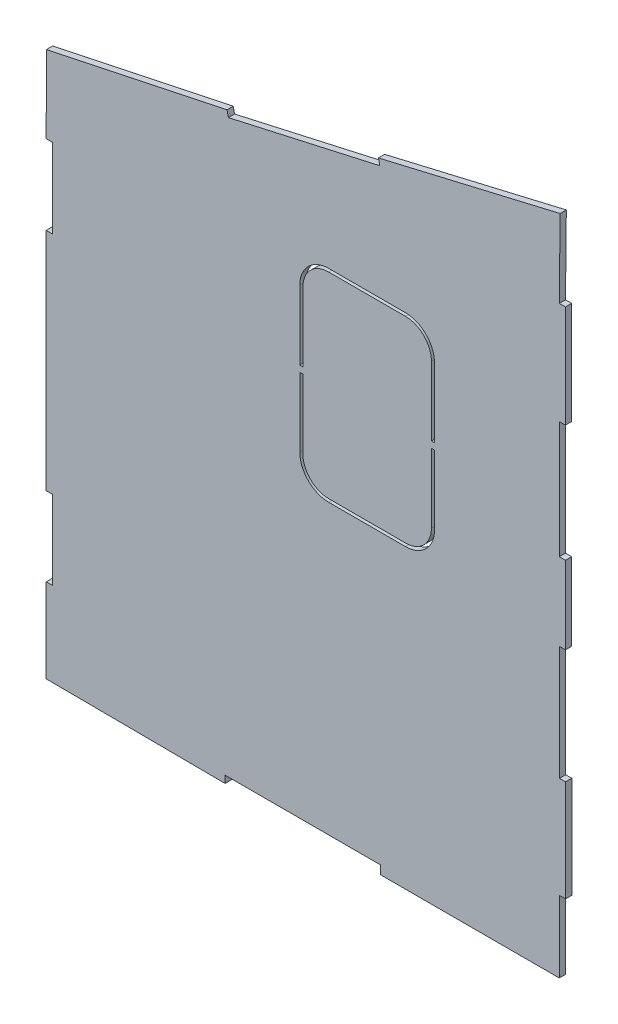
from build123d import *

# Parameters (mm, degrees)
BOSS_EXTRUDE1_DEPTH = 1.524
CUT_EXTRUDE1_DEPTH  = 1.524


with BuildPart() as part:
    # Sketch1 → Boss-Extrude1 (new body)
    with BuildSketch(Plane.XY):
        Polygon((9.092667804, 73.777555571), (9.043222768, 54.80583571), (10.60405165, 54.80583571), (10.557845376, 35.310728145), (9.043222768, 35.310728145), (9.043222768, -20.0520327), (10.601873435, -20.042029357), (10.601873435, -39.416526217), (9.043222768, -39.416526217), (9.043222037, -60.053816), (52.984742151, -60.324890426), (52.982423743, -58.565910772), (91.082423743, -58.565910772), (91.082423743, -60.671074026), (135.021624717, -60.671074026), (135.021624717, -43.08047166), (136.573671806, -43.08047166), (136.573671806, -18.16378675), (135.020697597, -18.229383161), (135.020697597, 9.858365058), (136.544697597, 9.858365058), (136.544697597, 28.908365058), (135.020697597, 28.908365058), (135.020697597, 57.632604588), (136.545359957, 57.654428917), (136.545359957, 82.788941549), (135.02455543, 82.763282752), (135.226572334, 101.990253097), (90.617790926, 91.505168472), (90.952162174, 90.018302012), (53.780500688, 81.659020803), (53.446129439, 83.145887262), align=None)
    extrude(amount=BOSS_EXTRUDE1_DEPTH)

    # Sketch2 → Cut-Extrude1 (cut)
    with BuildSketch(Plane.XY.offset(1.524)):
        with BuildLine():
            Line((104.388141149, 54.793396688), (104.388141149, 37.804892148))
            Line((104.388141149, 37.804892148), (103.626141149, 37.804892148))
            Line((103.626141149, 37.804892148), (103.626141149, 54.793396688))
            ThreePointArc((103.626141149, 54.793396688), (101.766269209, 59.283524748), (97.276141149, 61.143396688))
            Line((97.276141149, 61.143396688), (78.415983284, 61.143396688))
            ThreePointArc((78.415983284, 61.143396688), (73.925855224, 59.283524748), (72.065983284, 54.793396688))
            Line((72.065983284, 54.793396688), (72.065983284, 37.804892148))
            Line((72.065983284, 37.804892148), (71.303983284, 37.804892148))
            Line((71.303983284, 37.804892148), (71.303983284, 54.793396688))
            ThreePointArc((71.303983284, 54.793396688), (73.387039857, 59.822340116), (78.415983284, 61.905396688))
            Line((78.415983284, 61.905396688), (97.276141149, 61.905396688))
            ThreePointArc((97.276141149, 61.905396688), (102.305084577, 59.822340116), (104.388141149, 54.793396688))
        make_face()
        with BuildLine():
            Line((78.415983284, 12.942387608), (97.276141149, 12.942387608))
            ThreePointArc((97.276141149, 12.942387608), (101.766269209, 14.802259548), (103.626141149, 19.292387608))
            Line((103.626141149, 19.292387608), (103.626141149, 36.280892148))
            Line((103.626141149, 36.280892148), (104.388141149, 36.280892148))
            Line((104.388141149, 36.280892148), (104.388141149, 19.292387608))
            ThreePointArc((104.388141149, 19.292387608), (102.305084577, 14.263444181), (97.276141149, 12.180387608))
            Line((97.276141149, 12.180387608), (78.415983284, 12.180387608))
            ThreePointArc((78.415983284, 12.180387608), (73.387039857, 14.263444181), (71.303983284, 19.292387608))
            Line((71.303983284, 19.292387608), (71.303983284, 36.280892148))
            Line((71.303983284, 36.280892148), (72.065983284, 36.280892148))
            Line((72.065983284, 36.280892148), (72.065983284, 19.292387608))
            ThreePointArc((72.065983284, 19.292387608), (73.925855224, 14.802259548), (78.415983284, 12.942387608))
        make_face()
    extrude(amount=-CUT_EXTRUDE1_DEPTH, mode=Mode.SUBTRACT)


solid = part.part
